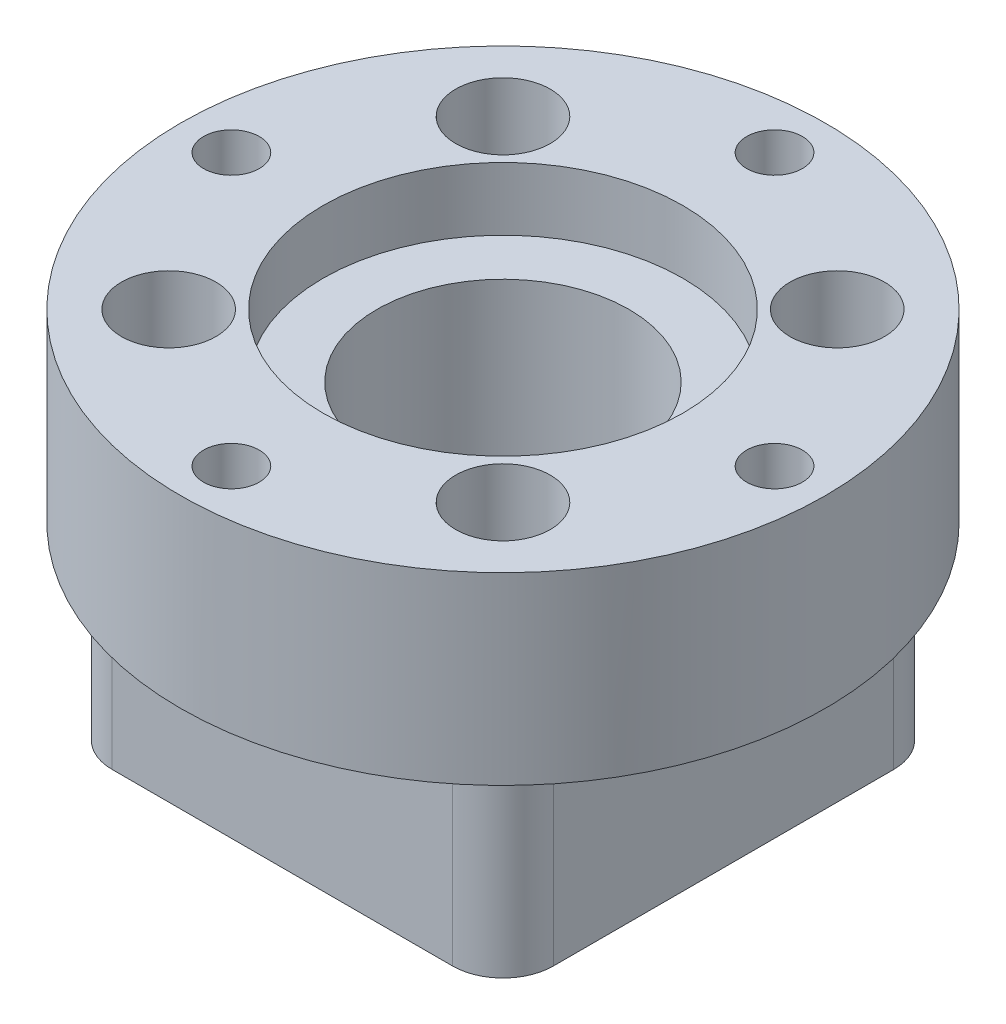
from build123d import *

# Parameters (mm, degrees)
SKETCH1_W                                       = 44.45
SKETCH1_H                                       = 44.45
BOSS_EXTRUDE1_DEPTH                             = 19.05
FILLET1_R                                       = 5.08
SKETCH2_R                                       = 32.5
BOSS_EXTRUDE2_DEPTH                             = 18.56474564
F_2_0_221_DIAMETER_HOLE1_D                      = 5.6134
CIRPATTERN1_COUNT                               = 4
CBORE_FOR_10_SOCKET_HEAD_CAP_SCREW1_D           = 5.1054
CBORE_FOR_10_SOCKET_HEAD_CAP_SCREW1_CBORE_D     = 9.525
CBORE_FOR_10_SOCKET_HEAD_CAP_SCREW1_CBORE_DEPTH = 12.7
CIRPATTERN2_COUNT                               = 4


with BuildPart() as part:
    # Sketch1 → Boss-Extrude1 (new body)
    with BuildSketch(Plane(origin=(0, 0, 0), x_dir=(1, 0, 0), z_dir=(0, 1, 0))):
        Rectangle(SKETCH1_W, SKETCH1_H)
    extrude(amount=BOSS_EXTRUDE1_DEPTH)

    # Fillet1
    fillet1_edges = [part.edges().sort_by_distance(p)[0] for p in [
        (22.225, 9.525, 22.225),
        (-22.225, 9.525, 22.225),
        (-22.225, 9.525, -22.225),
        (22.225, 9.525, -22.225),
    ]]
    fillet(fillet1_edges, radius=FILLET1_R)

    # Sketch2 → Boss-Extrude2 (add)
    with BuildSketch(Plane(origin=(0, 19.05, 0), x_dir=(1, 0, 0), z_dir=(0, 1, 0))):
        with Locations(Location((0, 0, 0), (0, 0, 180))):
            Circle(SKETCH2_R)
    extrude(amount=BOSS_EXTRUDE2_DEPTH)

    # Sketch3 → Cut-Revolve1 (revolve, cut)
    with BuildSketch(Plane.XY, mode=Mode.PRIVATE) as cut_revolve1_sk:
        Polygon((-18.127, 37.61474564), (-18.127, 31.26474564), (-12.7, 31.26474564), (-12.7, 7.62), (-19.1008, 7.62), (-19.1008, 0), (0, 0), (0, 37.61474564), align=None)
    revolve(cut_revolve1_sk.sketch.rotate(Axis((0, 0, 0), (0, 1, 0)), 270), axis=Axis((0, 0, 0), (0, 1, 0)), mode=Mode.SUBTRACT)

    # 2 _0.221_ Diameter Hole1 (through all)
    with Locations(Plane(origin=(0, 37.61474564, 0), x_dir=(1, 0, 0), z_dir=(0, 1, 0))):
        with Locations((-27.3625, 0)):
            f_2_0_221_diameter_hole1 = Hole(F_2_0_221_DIAMETER_HOLE1_D / 2)

    # CirPattern1: 2 _0.221_ Diameter Hole1 ×4 about axis
    cirpattern1_axis = Axis((0, 0, 0), (0, 1, 0))
    for i in range(1, CIRPATTERN1_COUNT):
        add(f_2_0_221_diameter_hole1.rotate(cirpattern1_axis, i * 360 / CIRPATTERN1_COUNT), mode=Mode.SUBTRACT)

    # CBORE for _10 Socket Head Cap Screw1 (through all)
    with Locations(Plane(origin=(1.032893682, 37.61474564, 8.275256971), x_dir=(-1, 0, 0), z_dir=(0, 1, 0))):
        with Locations((17.873093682, 8.564943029)):
            cbore_for_10_socket_head_cap_screw1 = CounterBoreHole(CBORE_FOR_10_SOCKET_HEAD_CAP_SCREW1_D / 2, CBORE_FOR_10_SOCKET_HEAD_CAP_SCREW1_CBORE_D / 2, CBORE_FOR_10_SOCKET_HEAD_CAP_SCREW1_CBORE_DEPTH)

    # CirPattern2: CBORE for _10 Socket Head Cap Screw1 ×4 about axis
    cirpattern2_axis = Axis((0, 0, 0), (0, 1, 0))
    for i in range(1, CIRPATTERN2_COUNT):
        add(cbore_for_10_socket_head_cap_screw1.rotate(cirpattern2_axis, i * 360 / CIRPATTERN2_COUNT), mode=Mode.SUBTRACT)


solid = part.part
